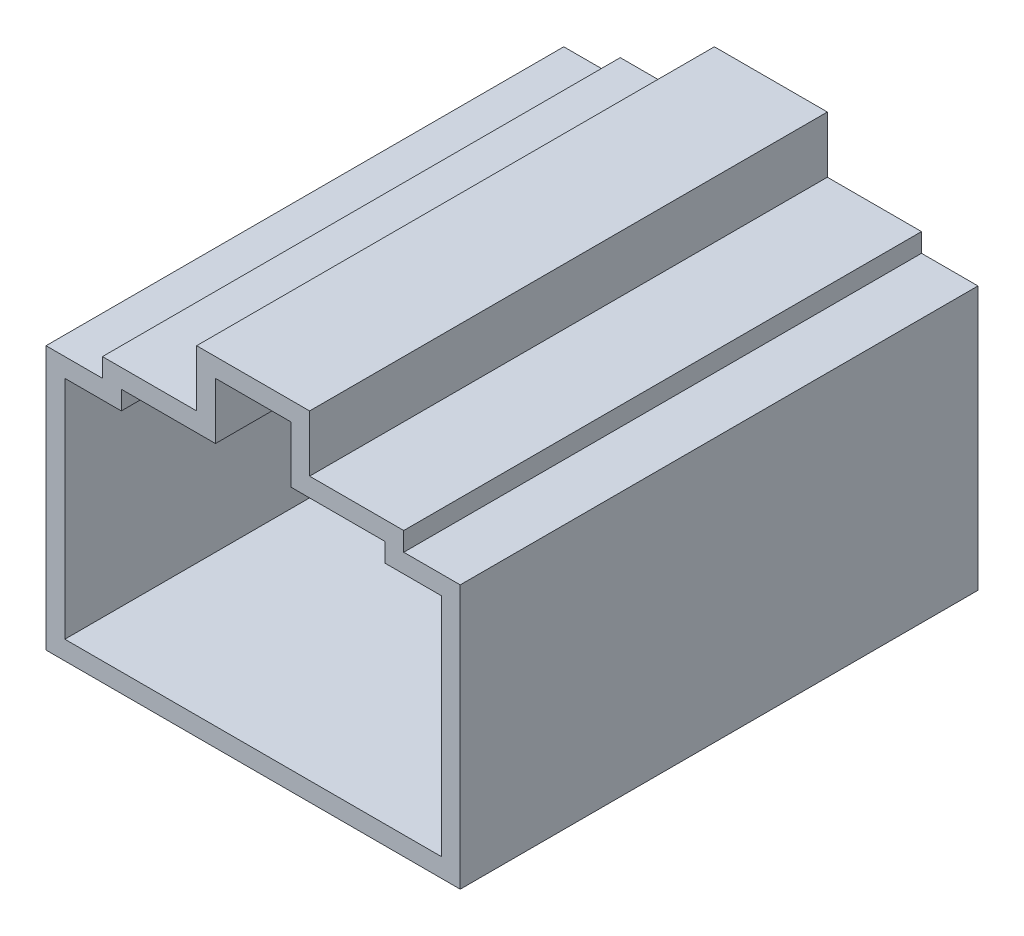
from build123d import *

# Parameters (mm, degrees)
BOSS_EXTRUDE1_DEPTH = 27.5


with BuildPart() as part:
    # Sketch1 → Boss-Extrude1 (new body)
    with BuildSketch(Plane.XY):
        Polygon((9.75, -11.121276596), (-12.25, -11.121276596), (-12.25, 2.878723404), (-9.25, 2.878723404), (-9.25, 3.878723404), (-4.25, 3.878723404), (-4.25, 6.878723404), (1.75, 6.878723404), (1.75, 3.878723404), (6.75, 3.878723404), (6.75, 2.878723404), (9.75, 2.878723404), align=None)
        Polygon((8.75, -10.121276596), (-11.25, -10.121276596), (-11.25, 1.878723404), (-8.25, 1.878723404), (-8.25, 2.878723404), (-3.25, 2.878723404), (-3.25, 5.878723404), (0.75, 5.878723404), (0.75, 2.878723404), (5.75, 2.878723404), (5.75, 1.878723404), (8.75, 1.878723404), align=None, mode=Mode.SUBTRACT)
    extrude(amount=BOSS_EXTRUDE1_DEPTH)


solid = part.part
